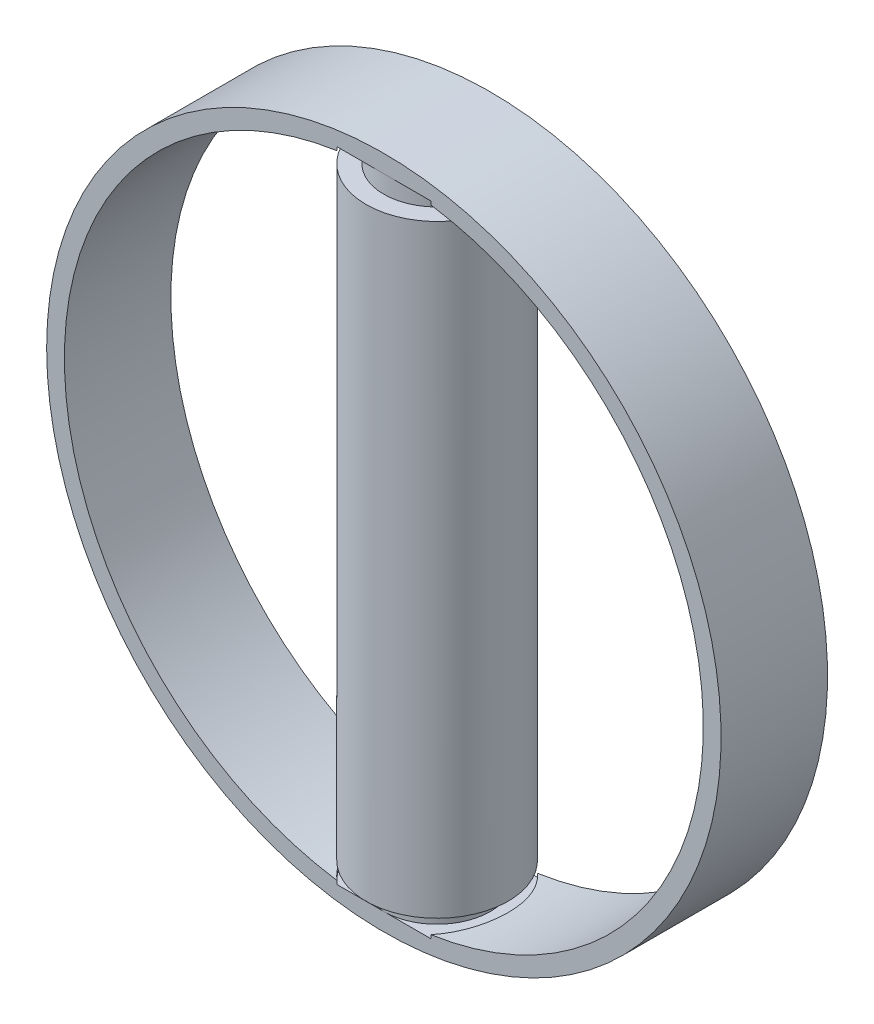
ISO-10303-21;
HEADER;
FILE_DESCRIPTION(('STEP AP214'),'2;1');
FILE_NAME('part.step','',(''),(''),'','','');
FILE_SCHEMA(('AUTOMOTIVE_DESIGN { 1 0 10303 214 1 1 1 1 }'));
ENDSEC;
DATA;
#1=APPLICATION_CONTEXT('core data for automotive mechanical design processes');
#2=APPLICATION_PROTOCOL_DEFINITION('international standard','automotive_design',2000,#1);
#3=PRODUCT_CONTEXT('',#1,'mechanical');
#4=PRODUCT('Part','Part','',(#3));
#5=PRODUCT_RELATED_PRODUCT_CATEGORY('part','',(#4));
#6=PRODUCT_DEFINITION_FORMATION('','',#4);
#7=PRODUCT_DEFINITION_CONTEXT('part definition',#1,'design');
#8=PRODUCT_DEFINITION('design','',#6,#7);
#9=PRODUCT_DEFINITION_SHAPE('','',#8);
#10=(LENGTH_UNIT() NAMED_UNIT(*) SI_UNIT(.MILLI.,.METRE.));
#11=(NAMED_UNIT(*) PLANE_ANGLE_UNIT() SI_UNIT($,.RADIAN.));
#12=(NAMED_UNIT(*) SI_UNIT($,.STERADIAN.) SOLID_ANGLE_UNIT());
#13=UNCERTAINTY_MEASURE_WITH_UNIT(LENGTH_MEASURE(1.E-05),#10,'distance_accuracy_value','');
#14=(GEOMETRIC_REPRESENTATION_CONTEXT(3) GLOBAL_UNCERTAINTY_ASSIGNED_CONTEXT((#13)) GLOBAL_UNIT_ASSIGNED_CONTEXT((#10,
#11,#12)) REPRESENTATION_CONTEXT('',''));
#15=CARTESIAN_POINT('',(0.,0.,0.));
#16=DIRECTION('',(0.,0.,1.));
#17=DIRECTION('',(1.,0.,0.));
#18=AXIS2_PLACEMENT_3D('',#15,#16,#17);
#19=CARTESIAN_POINT('',(0.,114.3,0.));
#20=DIRECTION('',(0.,-1.,0.));
#21=DIRECTION('',(0.,0.,-1.));
#22=AXIS2_PLACEMENT_3D('',#19,#20,#21);
#23=CYLINDRICAL_SURFACE('',#22,12.7);
#24=CARTESIAN_POINT('',(0.,111.125,0.));
#25=DIRECTION('',(0.,1.,0.));
#26=DIRECTION('',(0.,0.,1.));
#27=AXIS2_PLACEMENT_3D('',#24,#25,#26);
#28=CIRCLE('',#27,12.7);
#29=CARTESIAN_POINT('',(0.,111.125,12.7));
#30=VERTEX_POINT('',#29);
#31=EDGE_CURVE('E249',#30,#30,#28,.T.);
#32=ORIENTED_EDGE('',*,*,#31,.F.);
#33=EDGE_LOOP('',(#32));
#34=FACE_BOUND('',#33,.T.);
#35=CARTESIAN_POINT('',(0.,3.175,0.));
#36=DIRECTION('',(0.,-1.,0.));
#37=DIRECTION('',(0.,0.,-1.));
#38=AXIS2_PLACEMENT_3D('',#35,#36,#37);
#39=CIRCLE('',#38,12.7);
#40=CARTESIAN_POINT('',(0.,3.175,-12.7));
#41=VERTEX_POINT('',#40);
#42=EDGE_CURVE('E269',#41,#41,#39,.T.);
#43=ORIENTED_EDGE('',*,*,#42,.F.);
#44=EDGE_LOOP('',(#43));
#45=FACE_BOUND('',#44,.T.);
#46=ADVANCED_FACE('F45',(#34,#45),#23,.T.);
#47=CARTESIAN_POINT('',(0.,57.15,9.525));
#48=DIRECTION('',(0.,0.,1.));
#49=DIRECTION('',(1.,0.,0.));
#50=AXIS2_PLACEMENT_3D('',#47,#48,#49);
#51=PLANE('',#50);
#52=CARTESIAN_POINT('',(0.,57.15,9.525));
#53=DIRECTION('',(0.,0.,1.));
#54=DIRECTION('',(1.,0.,0.));
#55=AXIS2_PLACEMENT_3D('',#52,#53,#54);
#56=CIRCLE('',#55,60.325);
#57=CARTESIAN_POINT('',(-60.325,57.15,9.525));
#58=VERTEX_POINT('',#57);
#59=EDGE_CURVE('E224',#58,#58,#56,.T.);
#60=ORIENTED_EDGE('',*,*,#59,.T.);
#61=EDGE_LOOP('',(#60));
#62=FACE_BOUND('',#61,.T.);
#63=DIRECTION('',(0.,-1.,0.));
#64=VECTOR('',#63,1.);
#65=CARTESIAN_POINT('',(-8.40026041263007,114.3,9.525));
#66=LINE('',#65,#64);
#67=CARTESIAN_POINT('',(-8.40026041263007,114.3,9.525));
#68=VERTEX_POINT('',#67);
#69=CARTESIAN_POINT('',(-8.40026041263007,113.679267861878,9.525));
#70=VERTEX_POINT('',#69);
#71=EDGE_CURVE('E69',#68,#70,#66,.T.);
#72=ORIENTED_EDGE('',*,*,#71,.F.);
#73=DIRECTION('',(1.,0.,0.));
#74=VECTOR('',#73,1.);
#75=CARTESIAN_POINT('',(0.,114.3,9.525));
#76=LINE('',#75,#74);
#77=CARTESIAN_POINT('',(0.,114.3,9.525));
#78=VERTEX_POINT('',#77);
#79=EDGE_CURVE('E156',#68,#78,#76,.T.);
#80=ORIENTED_EDGE('',*,*,#79,.T.);
#81=CARTESIAN_POINT('',(8.40026041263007,114.3,9.525));
#82=VERTEX_POINT('',#81);
#83=EDGE_CURVE('E161',#78,#82,#76,.T.);
#84=ORIENTED_EDGE('',*,*,#83,.T.);
#85=DIRECTION('',(0.,-1.,0.));
#86=VECTOR('',#85,1.);
#87=CARTESIAN_POINT('',(8.40026041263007,114.3,9.525));
#88=LINE('',#87,#86);
#89=CARTESIAN_POINT('',(8.40026041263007,113.679267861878,9.525));
#90=VERTEX_POINT('',#89);
#91=EDGE_CURVE('E160',#90,#82,#88,.F.);
#92=ORIENTED_EDGE('',*,*,#91,.F.);
#93=CARTESIAN_POINT('',(0.,57.15,9.525));
#94=DIRECTION('',(0.,0.,1.));
#95=DIRECTION('',(1.,0.,0.));
#96=AXIS2_PLACEMENT_3D('',#93,#94,#95);
#97=CIRCLE('',#96,57.15);
#98=CARTESIAN_POINT('',(8.40026041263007,0.620732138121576,9.525));
#99=VERTEX_POINT('',#98);
#100=EDGE_CURVE('E242',#99,#90,#97,.T.);
#101=ORIENTED_EDGE('',*,*,#100,.F.);
#102=CARTESIAN_POINT('',(8.40026041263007,0.,9.525));
#103=VERTEX_POINT('',#102);
#104=EDGE_CURVE('E165',#103,#99,#88,.F.);
#105=ORIENTED_EDGE('',*,*,#104,.F.);
#106=DIRECTION('',(1.,0.,0.));
#107=VECTOR('',#106,1.);
#108=CARTESIAN_POINT('',(0.,0.,9.525));
#109=LINE('',#108,#107);
#110=CARTESIAN_POINT('',(0.,0.,9.525));
#111=VERTEX_POINT('',#110);
#112=EDGE_CURVE('E54',#111,#103,#109,.T.);
#113=ORIENTED_EDGE('',*,*,#112,.F.);
#114=CARTESIAN_POINT('',(-8.40026041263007,0.,9.525));
#115=VERTEX_POINT('',#114);
#116=EDGE_CURVE('E11',#115,#111,#109,.T.);
#117=ORIENTED_EDGE('',*,*,#116,.F.);
#118=CARTESIAN_POINT('',(-8.40026041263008,0.620732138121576,9.525));
#119=VERTEX_POINT('',#118);
#120=EDGE_CURVE('E162',#119,#115,#66,.T.);
#121=ORIENTED_EDGE('',*,*,#120,.F.);
#122=EDGE_CURVE('E234',#70,#119,#97,.T.);
#123=ORIENTED_EDGE('',*,*,#122,.F.);
#124=EDGE_LOOP('',(#72,#80,#84,#92,#101,#105,#113,#117,#121,#123));
#125=FACE_BOUND('',#124,.T.);
#126=ADVANCED_FACE('F201',(#62,#125),#51,.T.);
#127=CARTESIAN_POINT('',(0.,57.15,-9.525));
#128=DIRECTION('',(0.,0.,1.));
#129=DIRECTION('',(1.,0.,0.));
#130=AXIS2_PLACEMENT_3D('',#127,#128,#129);
#131=PLANE('',#130);
#132=CARTESIAN_POINT('',(0.,57.15,-9.525));
#133=DIRECTION('',(0.,0.,1.));
#134=DIRECTION('',(1.,0.,0.));
#135=AXIS2_PLACEMENT_3D('',#132,#133,#134);
#136=CIRCLE('',#135,60.325);
#137=CARTESIAN_POINT('',(-60.325,57.15,-9.525));
#138=VERTEX_POINT('',#137);
#139=EDGE_CURVE('E228',#138,#138,#136,.T.);
#140=ORIENTED_EDGE('',*,*,#139,.F.);
#141=EDGE_LOOP('',(#140));
#142=FACE_BOUND('',#141,.T.);
#143=DIRECTION('',(1.,0.,0.));
#144=VECTOR('',#143,1.);
#145=CARTESIAN_POINT('',(0.,114.3,-9.525));
#146=LINE('',#145,#144);
#147=CARTESIAN_POINT('',(-8.40026041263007,114.3,-9.525));
#148=VERTEX_POINT('',#147);
#149=CARTESIAN_POINT('',(0.,114.3,-9.525));
#150=VERTEX_POINT('',#149);
#151=EDGE_CURVE('E169',#148,#150,#146,.T.);
#152=ORIENTED_EDGE('',*,*,#151,.F.);
#153=DIRECTION('',(0.,-1.,0.));
#154=VECTOR('',#153,1.);
#155=CARTESIAN_POINT('',(-8.40026041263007,114.3,-9.525));
#156=LINE('',#155,#154);
#157=CARTESIAN_POINT('',(-8.40026041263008,113.679267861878,-9.52499999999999));
#158=VERTEX_POINT('',#157);
#159=EDGE_CURVE('E168',#148,#158,#156,.T.);
#160=ORIENTED_EDGE('',*,*,#159,.T.);
#161=CARTESIAN_POINT('',(0.,57.15,-9.525));
#162=DIRECTION('',(0.,0.,1.));
#163=DIRECTION('',(1.,0.,0.));
#164=AXIS2_PLACEMENT_3D('',#161,#162,#163);
#165=CIRCLE('',#164,57.15);
#166=CARTESIAN_POINT('',(-8.40026041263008,0.620732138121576,-9.52499999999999));
#167=VERTEX_POINT('',#166);
#168=EDGE_CURVE('E240',#158,#167,#165,.T.);
#169=ORIENTED_EDGE('',*,*,#168,.T.);
#170=CARTESIAN_POINT('',(-8.40026041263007,0.,-9.525));
#171=VERTEX_POINT('',#170);
#172=EDGE_CURVE('E61',#167,#171,#156,.T.);
#173=ORIENTED_EDGE('',*,*,#172,.T.);
#174=DIRECTION('',(1.,0.,0.));
#175=VECTOR('',#174,1.);
#176=CARTESIAN_POINT('',(0.,0.,-9.525));
#177=LINE('',#176,#175);
#178=CARTESIAN_POINT('',(0.,0.,-9.525));
#179=VERTEX_POINT('',#178);
#180=EDGE_CURVE('E137',#171,#179,#177,.T.);
#181=ORIENTED_EDGE('',*,*,#180,.T.);
#182=CARTESIAN_POINT('',(8.40026041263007,0.,-9.525));
#183=VERTEX_POINT('',#182);
#184=EDGE_CURVE('E125',#179,#183,#177,.T.);
#185=ORIENTED_EDGE('',*,*,#184,.T.);
#186=DIRECTION('',(0.,-1.,0.));
#187=VECTOR('',#186,1.);
#188=CARTESIAN_POINT('',(8.40026041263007,114.3,-9.525));
#189=LINE('',#188,#187);
#190=CARTESIAN_POINT('',(8.40026041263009,0.620732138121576,-9.52499999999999));
#191=VERTEX_POINT('',#190);
#192=EDGE_CURVE('E175',#183,#191,#189,.F.);
#193=ORIENTED_EDGE('',*,*,#192,.T.);
#194=CARTESIAN_POINT('',(8.40026041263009,113.679267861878,-9.52499999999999));
#195=VERTEX_POINT('',#194);
#196=EDGE_CURVE('E236',#191,#195,#165,.T.);
#197=ORIENTED_EDGE('',*,*,#196,.T.);
#198=CARTESIAN_POINT('',(8.40026041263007,114.3,-9.525));
#199=VERTEX_POINT('',#198);
#200=EDGE_CURVE('E172',#195,#199,#189,.F.);
#201=ORIENTED_EDGE('',*,*,#200,.T.);
#202=DIRECTION('',(-1.,0.,0.));
#203=VECTOR('',#202,1.);
#204=CARTESIAN_POINT('',(0.,114.3,-9.525));
#205=LINE('',#204,#203);
#206=EDGE_CURVE('E241',#199,#150,#205,.T.);
#207=ORIENTED_EDGE('',*,*,#206,.T.);
#208=EDGE_LOOP('',(#152,#160,#169,#173,#181,#185,#193,#197,#201,#207));
#209=FACE_BOUND('',#208,.T.);
#210=ADVANCED_FACE('F151',(#142,#209),#131,.F.);
#211=CARTESIAN_POINT('',(0.,57.15,9.525));
#212=DIRECTION('',(0.,0.,-1.));
#213=DIRECTION('',(-1.,0.,0.));
#214=AXIS2_PLACEMENT_3D('',#211,#212,#213);
#215=CYLINDRICAL_SURFACE('',#214,57.15);
#216=CARTESIAN_POINT('',(8.40026041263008,0.620732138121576,9.525));
#217=CARTESIAN_POINT('',(8.66792488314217,0.6605033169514,9.28898296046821));
#218=CARTESIAN_POINT('',(8.92555915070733,0.700735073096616,9.04167688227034));
#219=CARTESIAN_POINT('',(9.41913534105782,0.780994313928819,8.52625367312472));
#220=CARTESIAN_POINT('',(9.65507701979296,0.821021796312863,8.25813630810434));
#221=CARTESIAN_POINT('',(10.1036654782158,0.899752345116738,7.70281901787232));
#222=CARTESIAN_POINT('',(10.3163085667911,0.938455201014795,7.41561608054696));
#223=CARTESIAN_POINT('',(10.7167707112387,1.01342698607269,6.82410217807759));
#224=CARTESIAN_POINT('',(10.9045903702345,1.04969597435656,6.51979162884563));
#225=CARTESIAN_POINT('',(11.2542052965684,1.11878403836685,5.89583460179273));
#226=CARTESIAN_POINT('',(11.4159773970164,1.15160003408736,5.57617479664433));
#227=CARTESIAN_POINT('',(11.7120746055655,1.21277913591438,4.92397808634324));
#228=CARTESIAN_POINT('',(11.8464002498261,1.24114232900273,4.59144143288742));
#229=CARTESIAN_POINT('',(12.0865012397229,1.29255583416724,3.9159804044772));
#230=CARTESIAN_POINT('',(12.1922893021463,1.31560851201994,3.57306073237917));
#231=CARTESIAN_POINT('',(12.3745319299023,1.35571553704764,2.87917101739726));
#232=CARTESIAN_POINT('',(12.4509870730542,1.37277000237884,2.52820113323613));
#233=CARTESIAN_POINT('',(12.5730132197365,1.40015072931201,1.82604249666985));
#234=CARTESIAN_POINT('',(12.6190251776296,1.41057296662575,1.47493408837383));
#235=CARTESIAN_POINT('',(12.6815759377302,1.42477082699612,0.769967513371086));
#236=CARTESIAN_POINT('',(12.6981149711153,1.42854650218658,0.416109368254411));
#237=CARTESIAN_POINT('',(12.7015804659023,1.42933636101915,-0.291724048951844));
#238=CARTESIAN_POINT('',(12.6885098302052,1.4263512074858,-0.645699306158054));
#239=CARTESIAN_POINT('',(12.6328721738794,1.41371153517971,-1.35120164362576));
#240=CARTESIAN_POINT('',(12.5903053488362,1.40405706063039,-1.70272874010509));
#241=CARTESIAN_POINT('',(12.4769216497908,1.37857150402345,-2.39533918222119));
#242=CARTESIAN_POINT('',(12.406554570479,1.36283884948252,-2.73649992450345));
#243=CARTESIAN_POINT('',(12.2381402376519,1.32565180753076,-3.41159065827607));
#244=CARTESIAN_POINT('',(12.1400934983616,1.30419752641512,-3.74552078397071));
#245=CARTESIAN_POINT('',(11.9170171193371,1.25617016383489,-4.40404538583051));
#246=CARTESIAN_POINT('',(11.7919742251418,1.22959456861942,-4.72863518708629));
#247=CARTESIAN_POINT('',(11.5158618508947,1.17208204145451,-5.36615443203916));
#248=CARTESIAN_POINT('',(11.3647910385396,1.14114488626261,-5.6790832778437));
#249=CARTESIAN_POINT('',(11.0228502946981,1.07280003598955,-6.31902082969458));
#250=CARTESIAN_POINT('',(10.8296132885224,1.03505996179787,-6.64473200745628));
#251=CARTESIAN_POINT('',(10.4150167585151,0.956633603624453,-7.27739764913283));
#252=CARTESIAN_POINT('',(10.1936538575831,0.915946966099,-7.58434985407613));
#253=CARTESIAN_POINT('',(9.72440090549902,0.832904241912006,-8.17734721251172));
#254=CARTESIAN_POINT('',(9.47649356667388,0.790547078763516,-8.46337853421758));
#255=CARTESIAN_POINT('',(8.95623154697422,0.705531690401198,-9.01216565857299));
#256=CARTESIAN_POINT('',(8.68387924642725,0.6628734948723,-9.27492372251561));
#257=CARTESIAN_POINT('',(8.40026041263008,0.620732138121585,-9.525));
#258=B_SPLINE_CURVE_WITH_KNOTS('',3,(#216,#217,#218,#219,#220,#221,#222,#223,#224,#225,#226,
#227,#228,#229,#230,#231,#232,#233,#234,#235,#236,#237,#238,#239,#240,#241,#242,#243,#244,#245,
#246,#247,#248,#249,#250,#251,#252,#253,#254,#255,#256,#257),.UNSPECIFIED.,.F.,.F.,(4,2,2,2,2,2,
2,2,2,2,2,2,2,2,2,2,2,2,2,2,4),(0.,1.07688347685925,2.15377906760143,3.23084502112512,
4.3078848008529,5.38587727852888,6.46384869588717,7.54133895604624,8.61880799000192,
9.68030729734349,10.7417982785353,11.8031851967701,12.8645650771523,13.9094328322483,
14.9542811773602,15.9996436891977,17.0450597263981,18.1853015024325,19.3256803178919,
20.4668064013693,21.6078214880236),.UNSPECIFIED.);
#259=EDGE_CURVE('E178',#99,#191,#258,.T.);
#260=ORIENTED_EDGE('',*,*,#259,.F.);
#261=ORIENTED_EDGE('',*,*,#100,.T.);
#262=CARTESIAN_POINT('',(8.40026041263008,113.679267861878,-9.52499999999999));
#263=CARTESIAN_POINT('',(8.66792488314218,113.639496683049,-9.28898296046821));
#264=CARTESIAN_POINT('',(8.92555915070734,113.599264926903,-9.04167688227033));
#265=CARTESIAN_POINT('',(9.41913534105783,113.519005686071,-8.52625367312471));
#266=CARTESIAN_POINT('',(9.65507701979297,113.478978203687,-8.25813630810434));
#267=CARTESIAN_POINT('',(10.1036654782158,113.400247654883,-7.70281901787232));
#268=CARTESIAN_POINT('',(10.3163085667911,113.361544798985,-7.41561608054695));
#269=CARTESIAN_POINT('',(10.7167707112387,113.286573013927,-6.82410217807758));
#270=CARTESIAN_POINT('',(10.9045903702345,113.250304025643,-6.51979162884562));
#271=CARTESIAN_POINT('',(11.2542052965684,113.181215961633,-5.89583460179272));
#272=CARTESIAN_POINT('',(11.4159773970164,113.148399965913,-5.57617479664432));
#273=CARTESIAN_POINT('',(11.7120746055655,113.087220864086,-4.92397808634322));
#274=CARTESIAN_POINT('',(11.8464002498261,113.058857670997,-4.59144143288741));
#275=CARTESIAN_POINT('',(12.0865012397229,113.007444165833,-3.91598040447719));
#276=CARTESIAN_POINT('',(12.1922893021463,112.98439148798,-3.57306073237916));
#277=CARTESIAN_POINT('',(12.3745319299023,112.944284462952,-2.87917101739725));
#278=CARTESIAN_POINT('',(12.4509870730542,112.927229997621,-2.52820113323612));
#279=CARTESIAN_POINT('',(12.5730132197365,112.899849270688,-1.82604249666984));
#280=CARTESIAN_POINT('',(12.6190251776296,112.889427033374,-1.47493408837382));
#281=CARTESIAN_POINT('',(12.6815759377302,112.875229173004,-0.769967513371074));
#282=CARTESIAN_POINT('',(12.6981149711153,112.871453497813,-0.416109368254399));
#283=CARTESIAN_POINT('',(12.7015804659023,112.870663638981,0.291724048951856));
#284=CARTESIAN_POINT('',(12.6885098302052,112.873648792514,0.645699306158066));
#285=CARTESIAN_POINT('',(12.6328721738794,112.88628846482,1.35120164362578));
#286=CARTESIAN_POINT('',(12.5903053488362,112.89594293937,1.7027287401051));
#287=CARTESIAN_POINT('',(12.4769216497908,112.921428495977,2.3953391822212));
#288=CARTESIAN_POINT('',(12.406554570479,112.937161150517,2.73649992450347));
#289=CARTESIAN_POINT('',(12.2381402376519,112.974348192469,3.41159065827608));
#290=CARTESIAN_POINT('',(12.1400934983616,112.995802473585,3.74552078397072));
#291=CARTESIAN_POINT('',(11.9170171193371,113.043829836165,4.40404538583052));
#292=CARTESIAN_POINT('',(11.7919742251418,113.070405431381,4.72863518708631));
#293=CARTESIAN_POINT('',(11.5158618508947,113.127917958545,5.36615443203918));
#294=CARTESIAN_POINT('',(11.3647910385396,113.158855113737,5.67908327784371));
#295=CARTESIAN_POINT('',(11.0228502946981,113.22719996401,6.3190208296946));
#296=CARTESIAN_POINT('',(10.8296132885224,113.264940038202,6.64473200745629));
#297=CARTESIAN_POINT('',(10.4150167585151,113.343366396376,7.27739764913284));
#298=CARTESIAN_POINT('',(10.1936538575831,113.384053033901,7.58434985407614));
#299=CARTESIAN_POINT('',(9.72440090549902,113.467095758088,8.17734721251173));
#300=CARTESIAN_POINT('',(9.47649356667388,113.509452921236,8.46337853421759));
#301=CARTESIAN_POINT('',(8.95623154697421,113.594468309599,9.012165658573));
#302=CARTESIAN_POINT('',(8.68387924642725,113.637126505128,9.27492372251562));
#303=CARTESIAN_POINT('',(8.40026041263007,113.679267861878,9.525));
#304=B_SPLINE_CURVE_WITH_KNOTS('',3,(#262,#263,#264,#265,#266,#267,#268,#269,#270,#271,#272,
#273,#274,#275,#276,#277,#278,#279,#280,#281,#282,#283,#284,#285,#286,#287,#288,#289,#290,#291,
#292,#293,#294,#295,#296,#297,#298,#299,#300,#301,#302,#303),.UNSPECIFIED.,.F.,.F.,(4,2,2,2,2,2,
2,2,2,2,2,2,2,2,2,2,2,2,2,2,4),(0.,1.07688347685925,2.15377906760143,3.23084502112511,
4.3078848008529,5.38587727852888,6.46384869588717,7.54133895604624,8.61880799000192,
9.6803072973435,10.7417982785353,11.8031851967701,12.8645650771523,13.9094328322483,
14.9542811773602,15.9996436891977,17.0450597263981,18.1853015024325,19.3256803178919,
20.4668064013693,21.6078214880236),.UNSPECIFIED.);
#305=EDGE_CURVE('E213',#195,#90,#304,.T.);
#306=ORIENTED_EDGE('',*,*,#305,.F.);
#307=ORIENTED_EDGE('',*,*,#196,.F.);
#308=EDGE_LOOP('',(#260,#261,#306,#307));
#309=FACE_BOUND('',#308,.T.);
#310=ADVANCED_FACE('F192',(#309),#215,.F.);
#311=CARTESIAN_POINT('',(-8.40026041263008,113.679267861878,9.525));
#312=CARTESIAN_POINT('',(-8.66792488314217,113.639496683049,9.28898296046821));
#313=CARTESIAN_POINT('',(-8.92555915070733,113.599264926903,9.04167688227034));
#314=CARTESIAN_POINT('',(-9.41913534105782,113.519005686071,8.52625367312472));
#315=CARTESIAN_POINT('',(-9.65507701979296,113.478978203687,8.25813630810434));
#316=CARTESIAN_POINT('',(-10.1036654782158,113.400247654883,7.70281901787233));
#317=CARTESIAN_POINT('',(-10.3163085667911,113.361544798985,7.41561608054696));
#318=CARTESIAN_POINT('',(-10.7167707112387,113.286573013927,6.82410217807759));
#319=CARTESIAN_POINT('',(-10.9045903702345,113.250304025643,6.51979162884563));
#320=CARTESIAN_POINT('',(-11.2542052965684,113.181215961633,5.89583460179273));
#321=CARTESIAN_POINT('',(-11.4159773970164,113.148399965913,5.57617479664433));
#322=CARTESIAN_POINT('',(-11.7120746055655,113.087220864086,4.92397808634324));
#323=CARTESIAN_POINT('',(-11.8464002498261,113.058857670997,4.59144143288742));
#324=CARTESIAN_POINT('',(-12.0865012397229,113.007444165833,3.9159804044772));
#325=CARTESIAN_POINT('',(-12.1922893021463,112.98439148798,3.57306073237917));
#326=CARTESIAN_POINT('',(-12.3745319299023,112.944284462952,2.87917101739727));
#327=CARTESIAN_POINT('',(-12.4509870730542,112.927229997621,2.52820113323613));
#328=CARTESIAN_POINT('',(-12.5730132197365,112.899849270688,1.82604249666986));
#329=CARTESIAN_POINT('',(-12.6190251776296,112.889427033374,1.47493408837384));
#330=CARTESIAN_POINT('',(-12.6815759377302,112.875229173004,0.769967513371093));
#331=CARTESIAN_POINT('',(-12.6981149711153,112.871453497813,0.416109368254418));
#332=CARTESIAN_POINT('',(-12.7015804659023,112.870663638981,-0.291724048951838));
#333=CARTESIAN_POINT('',(-12.6885098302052,112.873648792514,-0.645699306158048));
#334=CARTESIAN_POINT('',(-12.6328721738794,112.88628846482,-1.35120164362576));
#335=CARTESIAN_POINT('',(-12.5903053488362,112.89594293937,-1.70272874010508));
#336=CARTESIAN_POINT('',(-12.4769216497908,112.921428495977,-2.39533918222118));
#337=CARTESIAN_POINT('',(-12.406554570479,112.937161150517,-2.73649992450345));
#338=CARTESIAN_POINT('',(-12.2381402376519,112.974348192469,-3.41159065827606));
#339=CARTESIAN_POINT('',(-12.1400934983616,112.995802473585,-3.74552078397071));
#340=CARTESIAN_POINT('',(-11.9170171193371,113.043829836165,-4.4040453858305));
#341=CARTESIAN_POINT('',(-11.7919742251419,113.070405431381,-4.72863518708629));
#342=CARTESIAN_POINT('',(-11.5158618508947,113.127917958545,-5.36615443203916));
#343=CARTESIAN_POINT('',(-11.3647910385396,113.158855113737,-5.6790832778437));
#344=CARTESIAN_POINT('',(-11.0228502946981,113.22719996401,-6.31902082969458));
#345=CARTESIAN_POINT('',(-10.8296132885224,113.264940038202,-6.64473200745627));
#346=CARTESIAN_POINT('',(-10.4150167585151,113.343366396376,-7.27739764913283));
#347=CARTESIAN_POINT('',(-10.1936538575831,113.384053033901,-7.58434985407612));
#348=CARTESIAN_POINT('',(-9.72440090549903,113.467095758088,-8.17734721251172));
#349=CARTESIAN_POINT('',(-9.47649356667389,113.509452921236,-8.46337853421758));
#350=CARTESIAN_POINT('',(-8.95623154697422,113.594468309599,-9.01216565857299));
#351=CARTESIAN_POINT('',(-8.68387924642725,113.637126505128,-9.27492372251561));
#352=CARTESIAN_POINT('',(-8.40026041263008,113.679267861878,-9.52499999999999));
#353=B_SPLINE_CURVE_WITH_KNOTS('',3,(#311,#312,#313,#314,#315,#316,#317,#318,#319,#320,#321,
#322,#323,#324,#325,#326,#327,#328,#329,#330,#331,#332,#333,#334,#335,#336,#337,#338,#339,#340,
#341,#342,#343,#344,#345,#346,#347,#348,#349,#350,#351,#352),.UNSPECIFIED.,.F.,.F.,(4,2,2,2,2,2,
2,2,2,2,2,2,2,2,2,2,2,2,2,2,4),(0.,1.07688347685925,2.15377906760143,3.23084502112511,
4.3078848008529,5.38587727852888,6.46384869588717,7.54133895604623,8.61880799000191,
9.68030729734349,10.7417982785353,11.8031851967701,12.8645650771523,13.9094328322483,
14.9542811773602,15.9996436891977,17.0450597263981,18.1853015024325,19.3256803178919,
20.4668064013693,21.6078214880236),.UNSPECIFIED.);
#354=EDGE_CURVE('E186',#70,#158,#353,.T.);
#355=ORIENTED_EDGE('',*,*,#354,.F.);
#356=ORIENTED_EDGE('',*,*,#122,.T.);
#357=CARTESIAN_POINT('',(-8.40026041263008,0.620732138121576,-9.52499999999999));
#358=CARTESIAN_POINT('',(-8.66792488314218,0.6605033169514,-9.28898296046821));
#359=CARTESIAN_POINT('',(-8.92555915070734,0.700735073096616,-9.04167688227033));
#360=CARTESIAN_POINT('',(-9.41913534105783,0.780994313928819,-8.52625367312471));
#361=CARTESIAN_POINT('',(-9.65507701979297,0.821021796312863,-8.25813630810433));
#362=CARTESIAN_POINT('',(-10.1036654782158,0.899752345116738,-7.70281901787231));
#363=CARTESIAN_POINT('',(-10.3163085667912,0.938455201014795,-7.41561608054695));
#364=CARTESIAN_POINT('',(-10.7167707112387,1.01342698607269,-6.82410217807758));
#365=CARTESIAN_POINT('',(-10.9045903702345,1.04969597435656,-6.51979162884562));
#366=CARTESIAN_POINT('',(-11.2542052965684,1.11878403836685,-5.89583460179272));
#367=CARTESIAN_POINT('',(-11.4159773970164,1.15160003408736,-5.57617479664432));
#368=CARTESIAN_POINT('',(-11.7120746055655,1.21277913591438,-4.92397808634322));
#369=CARTESIAN_POINT('',(-11.8464002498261,1.24114232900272,-4.59144143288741));
#370=CARTESIAN_POINT('',(-12.0865012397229,1.29255583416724,-3.91598040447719));
#371=CARTESIAN_POINT('',(-12.1922893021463,1.31560851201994,-3.57306073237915));
#372=CARTESIAN_POINT('',(-12.3745319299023,1.35571553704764,-2.87917101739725));
#373=CARTESIAN_POINT('',(-12.4509870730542,1.37277000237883,-2.52820113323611));
#374=CARTESIAN_POINT('',(-12.5730132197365,1.40015072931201,-1.82604249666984));
#375=CARTESIAN_POINT('',(-12.6190251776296,1.41057296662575,-1.47493408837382));
#376=CARTESIAN_POINT('',(-12.6815759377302,1.42477082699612,-0.769967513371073));
#377=CARTESIAN_POINT('',(-12.6981149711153,1.42854650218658,-0.416109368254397));
#378=CARTESIAN_POINT('',(-12.7015804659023,1.42933636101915,0.291724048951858));
#379=CARTESIAN_POINT('',(-12.6885098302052,1.4263512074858,0.645699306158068));
#380=CARTESIAN_POINT('',(-12.6328721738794,1.41371153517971,1.35120164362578));
#381=CARTESIAN_POINT('',(-12.5903053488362,1.40405706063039,1.7027287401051));
#382=CARTESIAN_POINT('',(-12.4769216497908,1.37857150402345,2.3953391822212));
#383=CARTESIAN_POINT('',(-12.406554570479,1.36283884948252,2.73649992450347));
#384=CARTESIAN_POINT('',(-12.2381402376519,1.32565180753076,3.41159065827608));
#385=CARTESIAN_POINT('',(-12.1400934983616,1.30419752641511,3.74552078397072));
#386=CARTESIAN_POINT('',(-11.9170171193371,1.25617016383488,4.40404538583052));
#387=CARTESIAN_POINT('',(-11.7919742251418,1.22959456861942,4.72863518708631));
#388=CARTESIAN_POINT('',(-11.5158618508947,1.17208204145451,5.36615443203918));
#389=CARTESIAN_POINT('',(-11.3647910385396,1.14114488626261,5.67908327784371));
#390=CARTESIAN_POINT('',(-11.0228502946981,1.07280003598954,6.3190208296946));
#391=CARTESIAN_POINT('',(-10.8296132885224,1.03505996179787,6.64473200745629));
#392=CARTESIAN_POINT('',(-10.4150167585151,0.956633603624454,7.27739764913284));
#393=CARTESIAN_POINT('',(-10.1936538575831,0.915946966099,7.58434985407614));
#394=CARTESIAN_POINT('',(-9.72440090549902,0.832904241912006,8.17734721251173));
#395=CARTESIAN_POINT('',(-9.47649356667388,0.790547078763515,8.46337853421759));
#396=CARTESIAN_POINT('',(-8.95623154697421,0.705531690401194,9.012165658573));
#397=CARTESIAN_POINT('',(-8.68387924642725,0.662873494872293,9.27492372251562));
#398=CARTESIAN_POINT('',(-8.40026041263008,0.620732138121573,9.525));
#399=B_SPLINE_CURVE_WITH_KNOTS('',3,(#357,#358,#359,#360,#361,#362,#363,#364,#365,#366,#367,
#368,#369,#370,#371,#372,#373,#374,#375,#376,#377,#378,#379,#380,#381,#382,#383,#384,#385,#386,
#387,#388,#389,#390,#391,#392,#393,#394,#395,#396,#397,#398),.UNSPECIFIED.,.F.,.F.,(4,2,2,2,2,2,
2,2,2,2,2,2,2,2,2,2,2,2,2,2,4),(0.,1.07688347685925,2.15377906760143,3.23084502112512,
4.3078848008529,5.38587727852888,6.46384869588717,7.54133895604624,8.61880799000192,
9.6803072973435,10.7417982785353,11.8031851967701,12.8645650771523,13.9094328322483,
14.9542811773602,15.9996436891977,17.0450597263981,18.1853015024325,19.3256803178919,
20.4668064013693,21.6078214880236),.UNSPECIFIED.);
#400=EDGE_CURVE('E206',#167,#119,#399,.T.);
#401=ORIENTED_EDGE('',*,*,#400,.F.);
#402=ORIENTED_EDGE('',*,*,#168,.F.);
#403=EDGE_LOOP('',(#355,#356,#401,#402));
#404=FACE_BOUND('',#403,.T.);
#405=ADVANCED_FACE('F197',(#404),#215,.F.);
#406=CARTESIAN_POINT('',(0.,57.15,9.525));
#407=DIRECTION('',(0.,0.,-1.));
#408=DIRECTION('',(-1.,0.,0.));
#409=AXIS2_PLACEMENT_3D('',#406,#407,#408);
#410=CYLINDRICAL_SURFACE('',#409,60.325);
#411=CARTESIAN_POINT('',(-60.325,57.15,9.525));
#412=CARTESIAN_POINT('',(-60.325,57.15,9.3265625));
#413=CARTESIAN_POINT('',(-60.325,57.15,9.128125));
#414=CARTESIAN_POINT('',(-60.325,57.15,8.73125));
#415=CARTESIAN_POINT('',(-60.325,57.15,8.5328125));
#416=CARTESIAN_POINT('',(-60.325,57.15,8.1359375));
#417=CARTESIAN_POINT('',(-60.325,57.15,7.9375));
#418=CARTESIAN_POINT('',(-60.325,57.15,7.540625));
#419=CARTESIAN_POINT('',(-60.325,57.15,7.3421875));
#420=CARTESIAN_POINT('',(-60.325,57.15,6.9453125));
#421=CARTESIAN_POINT('',(-60.325,57.15,6.746875));
#422=CARTESIAN_POINT('',(-60.325,57.15,6.35));
#423=CARTESIAN_POINT('',(-60.325,57.15,6.1515625));
#424=CARTESIAN_POINT('',(-60.325,57.15,5.7546875));
#425=CARTESIAN_POINT('',(-60.325,57.15,5.55625));
#426=CARTESIAN_POINT('',(-60.325,57.15,5.159375));
#427=CARTESIAN_POINT('',(-60.325,57.15,4.9609375));
#428=CARTESIAN_POINT('',(-60.325,57.15,4.5640625));
#429=CARTESIAN_POINT('',(-60.325,57.15,4.365625));
#430=CARTESIAN_POINT('',(-60.325,57.15,3.96875));
#431=CARTESIAN_POINT('',(-60.325,57.15,3.7703125));
#432=CARTESIAN_POINT('',(-60.325,57.15,3.3734375));
#433=CARTESIAN_POINT('',(-60.325,57.15,3.175));
#434=CARTESIAN_POINT('',(-60.325,57.15,2.778125));
#435=CARTESIAN_POINT('',(-60.325,57.15,2.5796875));
#436=CARTESIAN_POINT('',(-60.325,57.15,2.1828125));
#437=CARTESIAN_POINT('',(-60.325,57.15,1.984375));
#438=CARTESIAN_POINT('',(-60.325,57.15,1.5875));
#439=CARTESIAN_POINT('',(-60.325,57.15,1.3890625));
#440=CARTESIAN_POINT('',(-60.325,57.15,0.992187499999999));
#441=CARTESIAN_POINT('',(-60.325,57.15,0.793749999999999));
#442=CARTESIAN_POINT('',(-60.325,57.15,0.396874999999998));
#443=CARTESIAN_POINT('',(-60.325,57.15,0.198437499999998));
#444=CARTESIAN_POINT('',(-60.325,57.15,-0.198437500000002));
#445=CARTESIAN_POINT('',(-60.325,57.15,-0.396875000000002));
#446=CARTESIAN_POINT('',(-60.325,57.15,-0.793750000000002));
#447=CARTESIAN_POINT('',(-60.325,57.15,-0.992187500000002));
#448=CARTESIAN_POINT('',(-60.325,57.15,-1.3890625));
#449=CARTESIAN_POINT('',(-60.325,57.15,-1.5875));
#450=CARTESIAN_POINT('',(-60.325,57.15,-1.984375));
#451=CARTESIAN_POINT('',(-60.325,57.15,-2.1828125));
#452=CARTESIAN_POINT('',(-60.325,57.15,-2.5796875));
#453=CARTESIAN_POINT('',(-60.325,57.15,-2.778125));
#454=CARTESIAN_POINT('',(-60.325,57.15,-3.175));
#455=CARTESIAN_POINT('',(-60.325,57.15,-3.3734375));
#456=CARTESIAN_POINT('',(-60.325,57.15,-3.7703125));
#457=CARTESIAN_POINT('',(-60.325,57.15,-3.96875));
#458=CARTESIAN_POINT('',(-60.325,57.15,-4.365625));
#459=CARTESIAN_POINT('',(-60.325,57.15,-4.5640625));
#460=CARTESIAN_POINT('',(-60.325,57.15,-4.9609375));
#461=CARTESIAN_POINT('',(-60.325,57.15,-5.159375));
#462=CARTESIAN_POINT('',(-60.325,57.15,-5.55625));
#463=CARTESIAN_POINT('',(-60.325,57.15,-5.7546875));
#464=CARTESIAN_POINT('',(-60.325,57.15,-6.1515625));
#465=CARTESIAN_POINT('',(-60.325,57.15,-6.35));
#466=CARTESIAN_POINT('',(-60.325,57.15,-6.746875));
#467=CARTESIAN_POINT('',(-60.325,57.15,-6.9453125));
#468=CARTESIAN_POINT('',(-60.325,57.15,-7.3421875));
#469=CARTESIAN_POINT('',(-60.325,57.15,-7.540625));
#470=CARTESIAN_POINT('',(-60.325,57.15,-7.9375));
#471=CARTESIAN_POINT('',(-60.325,57.15,-8.1359375));
#472=CARTESIAN_POINT('',(-60.325,57.15,-8.5328125));
#473=CARTESIAN_POINT('',(-60.325,57.15,-8.73125));
#474=CARTESIAN_POINT('',(-60.325,57.15,-9.128125));
#475=CARTESIAN_POINT('',(-60.325,57.15,-9.3265625));
#476=CARTESIAN_POINT('',(-60.325,57.15,-9.525));
#477=B_SPLINE_CURVE_WITH_KNOTS('',3,(#411,#412,#413,#414,#415,#416,#417,#418,#419,#420,#421,
#422,#423,#424,#425,#426,#427,#428,#429,#430,#431,#432,#433,#434,#435,#436,#437,#438,#439,#440,
#441,#442,#443,#444,#445,#446,#447,#448,#449,#450,#451,#452,#453,#454,#455,#456,#457,#458,#459,
#460,#461,#462,#463,#464,#465,#466,#467,#468,#469,#470,#471,#472,#473,#474,#475,#476),
.UNSPECIFIED.,.F.,.F.,(4,2,2,2,2,2,2,2,2,2,2,2,2,2,2,2,2,2,2,2,2,2,2,2,2,2,2,2,2,2,2,2,4),(0.,
0.595312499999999,1.190625,1.7859375,2.38125,2.9765625,3.571875,4.1671875,4.7625,5.3578125,
5.953125,6.5484375,7.14375,7.7390625,8.334375,8.9296875,9.525,10.1203125,10.715625,11.3109375,
11.90625,12.5015625,13.096875,13.6921875,14.2875,14.8828125,15.478125,16.0734375,16.66875,
17.2640625,17.859375,18.4546875,19.05),.UNSPECIFIED.);
#478=EDGE_CURVE('BSEAM316',#58,#138,#477,.T.);
#479=ORIENTED_EDGE('',*,*,#59,.F.);
#480=ORIENTED_EDGE('',*,*,#139,.T.);
#481=ORIENTED_EDGE('',*,*,#478,.T.);
#482=ORIENTED_EDGE('',*,*,#478,.F.);
#483=EDGE_LOOP('',(#479,#481,#480,#482));
#484=FACE_BOUND('',#483,.T.);
#485=ADVANCED_FACE('F316',(#484),#410,.T.);
#486=CARTESIAN_POINT('',(0.,114.3,0.));
#487=DIRECTION('',(0.,1.,0.));
#488=DIRECTION('',(0.,0.,1.));
#489=AXIS2_PLACEMENT_3D('',#486,#487,#488);
#490=PLANE('',#489);
#491=ORIENTED_EDGE('',*,*,#83,.F.);
#492=CARTESIAN_POINT('',(0.,114.3,0.));
#493=DIRECTION('',(0.,1.,0.));
#494=DIRECTION('',(0.,0.,1.));
#495=AXIS2_PLACEMENT_3D('',#492,#493,#494);
#496=CIRCLE('',#495,9.525);
#497=EDGE_CURVE('E258',#78,#150,#496,.T.);
#498=ORIENTED_EDGE('',*,*,#497,.T.);
#499=ORIENTED_EDGE('',*,*,#206,.F.);
#500=CARTESIAN_POINT('',(0.,114.3,0.));
#501=DIRECTION('',(0.,1.,0.));
#502=DIRECTION('',(0.,0.,1.));
#503=AXIS2_PLACEMENT_3D('',#500,#501,#502);
#504=CIRCLE('',#503,12.7);
#505=EDGE_CURVE('E250',#82,#199,#504,.T.);
#506=ORIENTED_EDGE('',*,*,#505,.F.);
#507=EDGE_LOOP('',(#491,#498,#499,#506));
#508=FACE_BOUND('',#507,.T.);
#509=ADVANCED_FACE('F300',(#508),#490,.F.);
#510=ORIENTED_EDGE('',*,*,#79,.F.);
#511=EDGE_CURVE('E254',#148,#68,#504,.T.);
#512=ORIENTED_EDGE('',*,*,#511,.F.);
#513=ORIENTED_EDGE('',*,*,#151,.T.);
#514=EDGE_CURVE('E263',#150,#78,#496,.T.);
#515=ORIENTED_EDGE('',*,*,#514,.T.);
#516=EDGE_LOOP('',(#510,#512,#513,#515));
#517=FACE_BOUND('',#516,.T.);
#518=ADVANCED_FACE('F308',(#517),#490,.F.);
#519=CARTESIAN_POINT('',(0.,111.125,0.));
#520=DIRECTION('',(0.,1.,0.));
#521=DIRECTION('',(0.,0.,1.));
#522=AXIS2_PLACEMENT_3D('',#519,#520,#521);
#523=CYLINDRICAL_SURFACE('',#522,12.7);
#524=ORIENTED_EDGE('',*,*,#91,.T.);
#525=ORIENTED_EDGE('',*,*,#505,.T.);
#526=ORIENTED_EDGE('',*,*,#200,.F.);
#527=ORIENTED_EDGE('',*,*,#305,.T.);
#528=EDGE_LOOP('',(#524,#525,#526,#527));
#529=FACE_BOUND('',#528,.T.);
#530=ADVANCED_FACE('F298',(#529),#523,.F.);
#531=ORIENTED_EDGE('',*,*,#71,.T.);
#532=ORIENTED_EDGE('',*,*,#354,.T.);
#533=ORIENTED_EDGE('',*,*,#159,.F.);
#534=ORIENTED_EDGE('',*,*,#511,.T.);
#535=EDGE_LOOP('',(#531,#532,#533,#534));
#536=FACE_BOUND('',#535,.T.);
#537=ADVANCED_FACE('F199',(#536),#523,.F.);
#538=CARTESIAN_POINT('',(0.,111.125,0.));
#539=DIRECTION('',(0.,1.,0.));
#540=DIRECTION('',(0.,0.,1.));
#541=AXIS2_PLACEMENT_3D('',#538,#539,#540);
#542=PLANE('',#541);
#543=CARTESIAN_POINT('',(0.,111.125,0.));
#544=DIRECTION('',(0.,1.,0.));
#545=DIRECTION('',(0.,0.,1.));
#546=AXIS2_PLACEMENT_3D('',#543,#544,#545);
#547=CIRCLE('',#546,9.525);
#548=CARTESIAN_POINT('',(0.,111.125,9.525));
#549=VERTEX_POINT('',#548);
#550=EDGE_CURVE('E262',#549,#549,#547,.T.);
#551=ORIENTED_EDGE('',*,*,#550,.F.);
#552=EDGE_LOOP('',(#551));
#553=FACE_BOUND('',#552,.T.);
#554=ORIENTED_EDGE('',*,*,#31,.T.);
#555=EDGE_LOOP('',(#554));
#556=FACE_BOUND('',#555,.T.);
#557=ADVANCED_FACE('F345',(#553,#556),#542,.T.);
#558=CARTESIAN_POINT('',(0.,111.125,0.));
#559=DIRECTION('',(0.,1.,0.));
#560=DIRECTION('',(0.,0.,1.));
#561=AXIS2_PLACEMENT_3D('',#558,#559,#560);
#562=CYLINDRICAL_SURFACE('',#561,9.525);
#563=ORIENTED_EDGE('',*,*,#550,.T.);
#564=EDGE_LOOP('',(#563));
#565=FACE_BOUND('',#564,.T.);
#566=ORIENTED_EDGE('',*,*,#497,.F.);
#567=ORIENTED_EDGE('',*,*,#514,.F.);
#568=EDGE_LOOP('',(#566,#567));
#569=FACE_BOUND('',#568,.T.);
#570=ADVANCED_FACE('F305',(#565,#569),#562,.T.);
#571=CARTESIAN_POINT('',(0.,0.,0.));
#572=DIRECTION('',(0.,-1.,0.));
#573=DIRECTION('',(0.,0.,-1.));
#574=AXIS2_PLACEMENT_3D('',#571,#572,#573);
#575=PLANE('',#574);
#576=ORIENTED_EDGE('',*,*,#116,.T.);
#577=CARTESIAN_POINT('',(0.,0.,0.));
#578=DIRECTION('',(0.,-1.,0.));
#579=DIRECTION('',(0.,0.,-1.));
#580=AXIS2_PLACEMENT_3D('',#577,#578,#579);
#581=CIRCLE('',#580,9.525);
#582=EDGE_CURVE('E140',#111,#179,#581,.T.);
#583=ORIENTED_EDGE('',*,*,#582,.T.);
#584=ORIENTED_EDGE('',*,*,#180,.F.);
#585=CARTESIAN_POINT('',(0.,0.,0.));
#586=DIRECTION('',(0.,-1.,0.));
#587=DIRECTION('',(0.,0.,-1.));
#588=AXIS2_PLACEMENT_3D('',#585,#586,#587);
#589=CIRCLE('',#588,12.7);
#590=EDGE_CURVE('E270',#115,#171,#589,.T.);
#591=ORIENTED_EDGE('',*,*,#590,.F.);
#592=EDGE_LOOP('',(#576,#583,#584,#591));
#593=FACE_BOUND('',#592,.T.);
#594=ADVANCED_FACE('F141',(#593),#575,.F.);
#595=ORIENTED_EDGE('',*,*,#112,.T.);
#596=EDGE_CURVE('E132',#183,#103,#589,.T.);
#597=ORIENTED_EDGE('',*,*,#596,.F.);
#598=ORIENTED_EDGE('',*,*,#184,.F.);
#599=EDGE_CURVE('E129',#179,#111,#581,.T.);
#600=ORIENTED_EDGE('',*,*,#599,.T.);
#601=EDGE_LOOP('',(#595,#597,#598,#600));
#602=FACE_BOUND('',#601,.T.);
#603=ADVANCED_FACE('F127',(#602),#575,.F.);
#604=CARTESIAN_POINT('',(0.,3.175,0.));
#605=DIRECTION('',(0.,-1.,0.));
#606=DIRECTION('',(0.,0.,-1.));
#607=AXIS2_PLACEMENT_3D('',#604,#605,#606);
#608=CYLINDRICAL_SURFACE('',#607,12.7);
#609=ORIENTED_EDGE('',*,*,#104,.T.);
#610=ORIENTED_EDGE('',*,*,#259,.T.);
#611=ORIENTED_EDGE('',*,*,#192,.F.);
#612=ORIENTED_EDGE('',*,*,#596,.T.);
#613=EDGE_LOOP('',(#609,#610,#611,#612));
#614=FACE_BOUND('',#613,.T.);
#615=ADVANCED_FACE('F286',(#614),#608,.F.);
#616=ORIENTED_EDGE('',*,*,#120,.T.);
#617=ORIENTED_EDGE('',*,*,#590,.T.);
#618=ORIENTED_EDGE('',*,*,#172,.F.);
#619=ORIENTED_EDGE('',*,*,#400,.T.);
#620=EDGE_LOOP('',(#616,#617,#618,#619));
#621=FACE_BOUND('',#620,.T.);
#622=ADVANCED_FACE('F279',(#621),#608,.F.);
#623=CARTESIAN_POINT('',(0.,3.175,0.));
#624=DIRECTION('',(0.,-1.,0.));
#625=DIRECTION('',(0.,0.,-1.));
#626=AXIS2_PLACEMENT_3D('',#623,#624,#625);
#627=PLANE('',#626);
#628=CARTESIAN_POINT('',(0.,3.175,0.));
#629=DIRECTION('',(0.,-1.,0.));
#630=DIRECTION('',(0.,0.,-1.));
#631=AXIS2_PLACEMENT_3D('',#628,#629,#630);
#632=CIRCLE('',#631,9.525);
#633=CARTESIAN_POINT('',(0.,3.175,-9.525));
#634=VERTEX_POINT('',#633);
#635=EDGE_CURVE('E149',#634,#634,#632,.T.);
#636=ORIENTED_EDGE('',*,*,#635,.F.);
#637=EDGE_LOOP('',(#636));
#638=FACE_BOUND('',#637,.T.);
#639=ORIENTED_EDGE('',*,*,#42,.T.);
#640=EDGE_LOOP('',(#639));
#641=FACE_BOUND('',#640,.T.);
#642=ADVANCED_FACE('F332',(#638,#641),#627,.T.);
#643=CARTESIAN_POINT('',(0.,3.175,0.));
#644=DIRECTION('',(0.,-1.,0.));
#645=DIRECTION('',(0.,0.,-1.));
#646=AXIS2_PLACEMENT_3D('',#643,#644,#645);
#647=CYLINDRICAL_SURFACE('',#646,9.525);
#648=ORIENTED_EDGE('',*,*,#635,.T.);
#649=EDGE_LOOP('',(#648));
#650=FACE_BOUND('',#649,.T.);
#651=ORIENTED_EDGE('',*,*,#599,.F.);
#652=ORIENTED_EDGE('',*,*,#582,.F.);
#653=EDGE_LOOP('',(#651,#652));
#654=FACE_BOUND('',#653,.T.);
#655=ADVANCED_FACE('F147',(#650,#654),#647,.T.);
#656=CLOSED_SHELL('',(#46,#126,#210,#310,#405,#485,#509,#518,#530,#537,#557,#570,#594,#603,#615,
#622,#642,#655));
#657=MANIFOLD_SOLID_BREP('B2',#656);
#658=ADVANCED_BREP_SHAPE_REPRESENTATION('',(#18,#657),#14);
#659=SHAPE_DEFINITION_REPRESENTATION(#9,#658);
ENDSEC;
END-ISO-10303-21;
